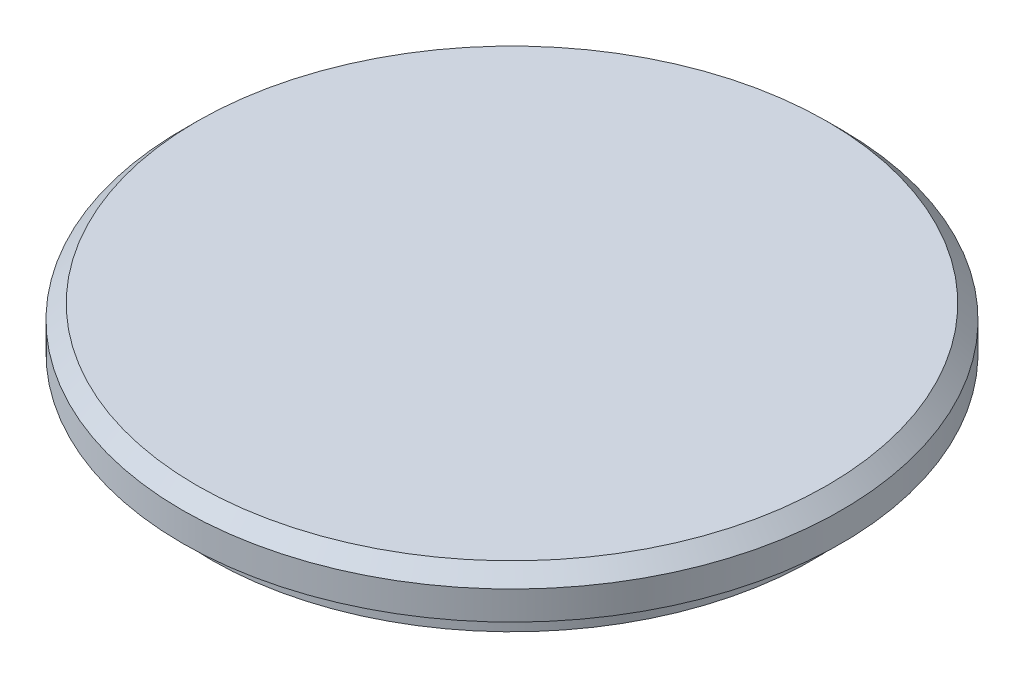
from build123d import *


with BuildPart() as part:
    # Esquisse1 → Base-R_volution (revolve)
    with BuildSketch(Plane.XY, mode=Mode.PRIVATE) as base_r_volution_sk:
        with BuildLine():
            Line((0, 12), (22, 12))
            Line((22, 12), (23, 11))
            Line((23, 11), (23, 9))
            Line((23, 9), (21, 9))
            Line((21, 9), (21, 7))
            Line((21, 7), (19, 7))
            Line((19, 7), (19, 9.5))
            ThreePointArc((19, 9.5), (18.853553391, 9.853553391), (18.5, 10))
            Line((18.5, 10), (0, 10))
            Line((0, 10), (0, 12))
        make_face()
    revolve(base_r_volution_sk.sketch.rotate(Axis((0, 60, 0), (0, -1, 0)), 90), axis=Axis((0, 60, 0), (0, -1, 0)))


solid = part.part
